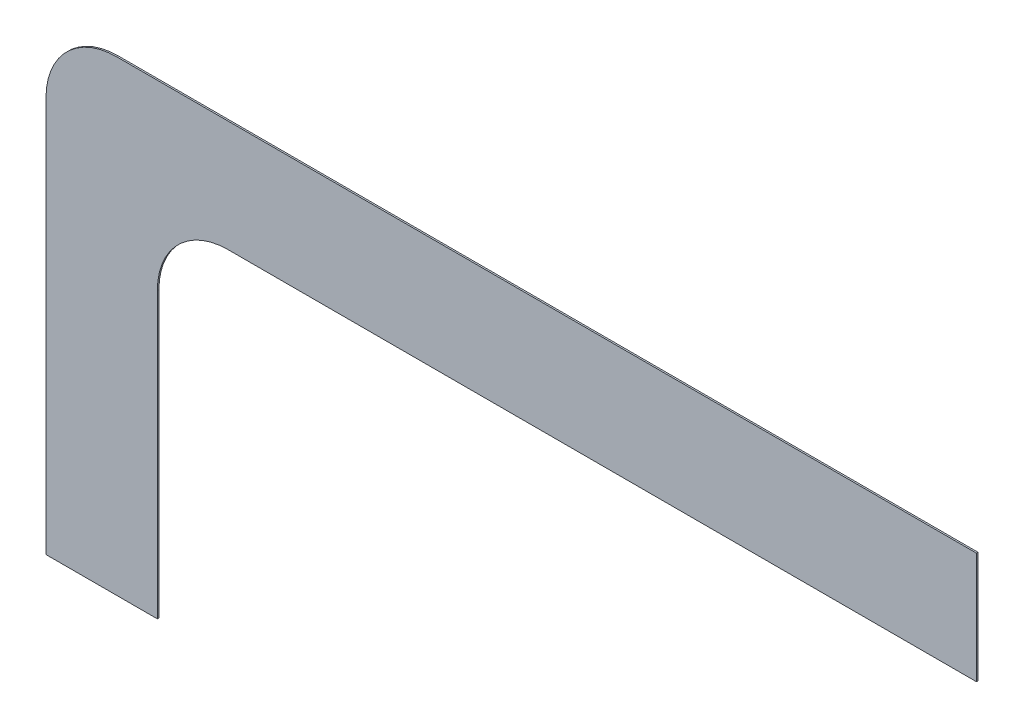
ISO-10303-21;
HEADER;
FILE_DESCRIPTION(('STEP AP214'),'2;1');
FILE_NAME('part.step','',(''),(''),'','','');
FILE_SCHEMA(('AUTOMOTIVE_DESIGN { 1 0 10303 214 1 1 1 1 }'));
ENDSEC;
DATA;
#1=APPLICATION_CONTEXT('core data for automotive mechanical design processes');
#2=APPLICATION_PROTOCOL_DEFINITION('international standard','automotive_design',2000,#1);
#3=PRODUCT_CONTEXT('',#1,'mechanical');
#4=PRODUCT('Part','Part','',(#3));
#5=PRODUCT_RELATED_PRODUCT_CATEGORY('part','',(#4));
#6=PRODUCT_DEFINITION_FORMATION('','',#4);
#7=PRODUCT_DEFINITION_CONTEXT('part definition',#1,'design');
#8=PRODUCT_DEFINITION('design','',#6,#7);
#9=PRODUCT_DEFINITION_SHAPE('','',#8);
#10=(LENGTH_UNIT() NAMED_UNIT(*) SI_UNIT(.MILLI.,.METRE.));
#11=(NAMED_UNIT(*) PLANE_ANGLE_UNIT() SI_UNIT($,.RADIAN.));
#12=(NAMED_UNIT(*) SI_UNIT($,.STERADIAN.) SOLID_ANGLE_UNIT());
#13=UNCERTAINTY_MEASURE_WITH_UNIT(LENGTH_MEASURE(1.E-05),#10,'distance_accuracy_value','');
#14=(GEOMETRIC_REPRESENTATION_CONTEXT(3) GLOBAL_UNCERTAINTY_ASSIGNED_CONTEXT((#13)) GLOBAL_UNIT_ASSIGNED_CONTEXT((#10,
#11,#12)) REPRESENTATION_CONTEXT('',''));
#15=CARTESIAN_POINT('',(0.,0.,0.));
#16=DIRECTION('',(0.,0.,1.));
#17=DIRECTION('',(1.,0.,0.));
#18=AXIS2_PLACEMENT_3D('',#15,#16,#17);
#19=CARTESIAN_POINT('',(33.5061595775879,-19.12,-0.949600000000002));
#20=DIRECTION('',(0.,-1.,0.));
#21=DIRECTION('',(-1.,0.,0.));
#22=AXIS2_PLACEMENT_3D('',#19,#20,#21);
#23=PLANE('',#22);
#24=DIRECTION('',(-1.,0.,0.));
#25=VECTOR('',#24,1.);
#26=CARTESIAN_POINT('',(33.5061595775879,-19.12,-0.949600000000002));
#27=LINE('',#26,#25);
#28=CARTESIAN_POINT('',(93.435,-19.12,-0.949599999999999));
#29=VERTEX_POINT('',#28);
#30=CARTESIAN_POINT('',(16.2277746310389,-19.12,-0.949600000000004));
#31=VERTEX_POINT('',#30);
#32=EDGE_CURVE('E12',#29,#31,#27,.T.);
#33=ORIENTED_EDGE('',*,*,#32,.T.);
#34=DIRECTION('',(0.,0.,-1.));
#35=VECTOR('',#34,1.);
#36=CARTESIAN_POINT('',(16.2277746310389,-19.12,-0.949600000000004));
#37=LINE('',#36,#35);
#38=CARTESIAN_POINT('',(16.2277746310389,-19.12,-0.809600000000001));
#39=VERTEX_POINT('',#38);
#40=EDGE_CURVE('E123',#39,#31,#37,.T.);
#41=ORIENTED_EDGE('',*,*,#40,.F.);
#42=DIRECTION('',(-1.,0.,0.));
#43=VECTOR('',#42,1.);
#44=CARTESIAN_POINT('',(33.5061595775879,-19.12,-0.809600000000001));
#45=LINE('',#44,#43);
#46=CARTESIAN_POINT('',(93.435,-19.12,-0.809599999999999));
#47=VERTEX_POINT('',#46);
#48=EDGE_CURVE('E49',#47,#39,#45,.T.);
#49=ORIENTED_EDGE('',*,*,#48,.F.);
#50=DIRECTION('',(0.,0.,-1.));
#51=VECTOR('',#50,1.);
#52=CARTESIAN_POINT('',(93.435,-19.12,-0.949599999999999));
#53=LINE('',#52,#51);
#54=EDGE_CURVE('E120',#47,#29,#53,.T.);
#55=ORIENTED_EDGE('',*,*,#54,.T.);
#56=EDGE_LOOP('',(#33,#41,#49,#55));
#57=FACE_BOUND('',#56,.T.);
#58=ADVANCED_FACE('F45',(#57),#23,.F.);
#59=CARTESIAN_POINT('',(33.5061595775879,-29.12,-0.949600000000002));
#60=DIRECTION('',(0.,-1.,0.));
#61=DIRECTION('',(-1.,0.,0.));
#62=AXIS2_PLACEMENT_3D('',#59,#60,#61);
#63=PLANE('',#62);
#64=DIRECTION('',(-1.,0.,0.));
#65=VECTOR('',#64,1.);
#66=CARTESIAN_POINT('',(33.5061595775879,-29.12,-0.949600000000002));
#67=LINE('',#66,#65);
#68=CARTESIAN_POINT('',(93.435,-29.12,-0.949599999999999));
#69=VERTEX_POINT('',#68);
#70=CARTESIAN_POINT('',(26.2277746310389,-29.12,-0.949600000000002));
#71=VERTEX_POINT('',#70);
#72=EDGE_CURVE('E55',#69,#71,#67,.T.);
#73=ORIENTED_EDGE('',*,*,#72,.F.);
#74=DIRECTION('',(0.,0.,-1.));
#75=VECTOR('',#74,1.);
#76=CARTESIAN_POINT('',(93.435,-29.12,-0.949599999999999));
#77=LINE('',#76,#75);
#78=CARTESIAN_POINT('',(93.435,-29.12,-0.809599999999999));
#79=VERTEX_POINT('',#78);
#80=EDGE_CURVE('E138',#79,#69,#77,.T.);
#81=ORIENTED_EDGE('',*,*,#80,.F.);
#82=DIRECTION('',(-1.,0.,0.));
#83=VECTOR('',#82,1.);
#84=CARTESIAN_POINT('',(33.5061595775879,-29.12,-0.809600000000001));
#85=LINE('',#84,#83);
#86=CARTESIAN_POINT('',(26.2277746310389,-29.12,-0.809600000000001));
#87=VERTEX_POINT('',#86);
#88=EDGE_CURVE('E108',#79,#87,#85,.T.);
#89=ORIENTED_EDGE('',*,*,#88,.T.);
#90=DIRECTION('',(0.,0.,-1.));
#91=VECTOR('',#90,1.);
#92=CARTESIAN_POINT('',(26.2277746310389,-29.12,-0.949600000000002));
#93=LINE('',#92,#91);
#94=EDGE_CURVE('E148',#87,#71,#93,.T.);
#95=ORIENTED_EDGE('',*,*,#94,.T.);
#96=EDGE_LOOP('',(#73,#81,#89,#95));
#97=FACE_BOUND('',#96,.T.);
#98=ADVANCED_FACE('F175',(#97),#63,.T.);
#99=CARTESIAN_POINT('',(75.9349999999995,-90.0207415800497,-0.949599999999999));
#100=DIRECTION('',(0.,0.,-1.));
#101=DIRECTION('',(-1.,0.,0.));
#102=AXIS2_PLACEMENT_3D('',#99,#100,#101);
#103=PLANE('',#102);
#104=ORIENTED_EDGE('',*,*,#32,.F.);
#105=DIRECTION('',(0.,1.,0.));
#106=VECTOR('',#105,1.);
#107=CARTESIAN_POINT('',(93.435,-90.0207415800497,-0.949599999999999));
#108=LINE('',#107,#106);
#109=EDGE_CURVE('E130',#69,#29,#108,.T.);
#110=ORIENTED_EDGE('',*,*,#109,.F.);
#111=ORIENTED_EDGE('',*,*,#72,.T.);
#112=CARTESIAN_POINT('',(26.2277746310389,-35.47,-0.949600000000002));
#113=DIRECTION('',(0.,0.,-1.));
#114=DIRECTION('',(-1.,0.,0.));
#115=AXIS2_PLACEMENT_3D('',#112,#113,#114);
#116=CIRCLE('',#115,6.35);
#117=CARTESIAN_POINT('',(19.8777746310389,-35.47,-0.949600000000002));
#118=VERTEX_POINT('',#117);
#119=EDGE_CURVE('E150',#71,#118,#116,.F.);
#120=ORIENTED_EDGE('',*,*,#119,.T.);
#121=DIRECTION('',(0.,1.,0.));
#122=VECTOR('',#121,1.);
#123=CARTESIAN_POINT('',(19.8777746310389,-29.12,-0.949600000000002));
#124=LINE('',#123,#122);
#125=CARTESIAN_POINT('',(19.8777746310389,-61.0106,-0.949600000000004));
#126=VERTEX_POINT('',#125);
#127=EDGE_CURVE('E169',#126,#118,#124,.T.);
#128=ORIENTED_EDGE('',*,*,#127,.F.);
#129=DIRECTION('',(1.,0.,0.));
#130=VECTOR('',#129,1.);
#131=CARTESIAN_POINT('',(9.87777463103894,-61.0106,-0.949600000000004));
#132=LINE('',#131,#130);
#133=CARTESIAN_POINT('',(9.87777463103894,-61.0106,-0.949600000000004));
#134=VERTEX_POINT('',#133);
#135=EDGE_CURVE('E134',#134,#126,#132,.T.);
#136=ORIENTED_EDGE('',*,*,#135,.F.);
#137=DIRECTION('',(0.,-1.,0.));
#138=VECTOR('',#137,1.);
#139=CARTESIAN_POINT('',(9.87777463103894,-19.12,-0.949600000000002));
#140=LINE('',#139,#138);
#141=CARTESIAN_POINT('',(9.87777463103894,-25.47,-0.949600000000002));
#142=VERTEX_POINT('',#141);
#143=EDGE_CURVE('E156',#142,#134,#140,.T.);
#144=ORIENTED_EDGE('',*,*,#143,.F.);
#145=CARTESIAN_POINT('',(16.2277746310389,-25.47,-0.949600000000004));
#146=DIRECTION('',(0.,0.,-1.));
#147=DIRECTION('',(-1.,0.,0.));
#148=AXIS2_PLACEMENT_3D('',#145,#146,#147);
#149=CIRCLE('',#148,6.35);
#150=EDGE_CURVE('E153',#142,#31,#149,.T.);
#151=ORIENTED_EDGE('',*,*,#150,.T.);
#152=EDGE_LOOP('',(#104,#110,#111,#120,#128,#136,#144,#151));
#153=FACE_BOUND('',#152,.T.);
#154=ADVANCED_FACE('F47',(#153),#103,.T.);
#155=CARTESIAN_POINT('',(33.5061595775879,-90.0207415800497,-0.809600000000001));
#156=DIRECTION('',(0.,0.,-1.));
#157=DIRECTION('',(-1.,0.,0.));
#158=AXIS2_PLACEMENT_3D('',#155,#156,#157);
#159=PLANE('',#158);
#160=ORIENTED_EDGE('',*,*,#88,.F.);
#161=DIRECTION('',(0.,1.,0.));
#162=VECTOR('',#161,1.);
#163=CARTESIAN_POINT('',(93.435,-90.0207415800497,-0.809599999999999));
#164=LINE('',#163,#162);
#165=EDGE_CURVE('E128',#79,#47,#164,.T.);
#166=ORIENTED_EDGE('',*,*,#165,.T.);
#167=ORIENTED_EDGE('',*,*,#48,.T.);
#168=CARTESIAN_POINT('',(16.2277746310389,-25.47,-0.809600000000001));
#169=DIRECTION('',(0.,0.,-1.));
#170=DIRECTION('',(-1.,0.,0.));
#171=AXIS2_PLACEMENT_3D('',#168,#169,#170);
#172=CIRCLE('',#171,6.35);
#173=CARTESIAN_POINT('',(9.87777463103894,-25.47,-0.809600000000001));
#174=VERTEX_POINT('',#173);
#175=EDGE_CURVE('E162',#174,#39,#172,.T.);
#176=ORIENTED_EDGE('',*,*,#175,.F.);
#177=DIRECTION('',(0.,1.,0.));
#178=VECTOR('',#177,1.);
#179=CARTESIAN_POINT('',(9.87777463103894,0.,-0.809600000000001));
#180=LINE('',#179,#178);
#181=CARTESIAN_POINT('',(9.87777463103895,-61.0106,-0.809600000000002));
#182=VERTEX_POINT('',#181);
#183=EDGE_CURVE('E145',#174,#182,#180,.F.);
#184=ORIENTED_EDGE('',*,*,#183,.T.);
#185=DIRECTION('',(-1.,0.,0.));
#186=VECTOR('',#185,1.);
#187=CARTESIAN_POINT('',(-0.302225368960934,-61.0106,-0.809600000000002));
#188=LINE('',#187,#186);
#189=CARTESIAN_POINT('',(19.8777746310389,-61.0106,-0.809600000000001));
#190=VERTEX_POINT('',#189);
#191=EDGE_CURVE('E143',#182,#190,#188,.F.);
#192=ORIENTED_EDGE('',*,*,#191,.T.);
#193=DIRECTION('',(0.,1.,0.));
#194=VECTOR('',#193,1.);
#195=CARTESIAN_POINT('',(19.8777746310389,0.,-0.809600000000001));
#196=LINE('',#195,#194);
#197=CARTESIAN_POINT('',(19.8777746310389,-35.47,-0.809600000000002));
#198=VERTEX_POINT('',#197);
#199=EDGE_CURVE('E140',#190,#198,#196,.T.);
#200=ORIENTED_EDGE('',*,*,#199,.T.);
#201=CARTESIAN_POINT('',(26.2277746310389,-35.47,-0.809600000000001));
#202=DIRECTION('',(0.,0.,-1.));
#203=DIRECTION('',(-1.,0.,0.));
#204=AXIS2_PLACEMENT_3D('',#201,#202,#203);
#205=CIRCLE('',#204,6.35);
#206=EDGE_CURVE('E166',#87,#198,#205,.F.);
#207=ORIENTED_EDGE('',*,*,#206,.F.);
#208=EDGE_LOOP('',(#160,#166,#167,#176,#184,#192,#200,#207));
#209=FACE_BOUND('',#208,.T.);
#210=ADVANCED_FACE('F132',(#209),#159,.F.);
#211=CARTESIAN_POINT('',(9.87777463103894,-61.0106,-0.949600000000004));
#212=DIRECTION('',(0.,1.,0.));
#213=DIRECTION('',(1.,0.,0.));
#214=AXIS2_PLACEMENT_3D('',#211,#212,#213);
#215=PLANE('',#214);
#216=DIRECTION('',(0.,0.,-1.));
#217=VECTOR('',#216,1.);
#218=CARTESIAN_POINT('',(19.8777746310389,-61.0106,-0.949600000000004));
#219=LINE('',#218,#217);
#220=EDGE_CURVE('E102',#190,#126,#219,.T.);
#221=ORIENTED_EDGE('',*,*,#220,.F.);
#222=ORIENTED_EDGE('',*,*,#191,.F.);
#223=DIRECTION('',(0.,0.,-1.));
#224=VECTOR('',#223,1.);
#225=CARTESIAN_POINT('',(9.87777463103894,-61.0106,-0.949600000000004));
#226=LINE('',#225,#224);
#227=EDGE_CURVE('E98',#182,#134,#226,.T.);
#228=ORIENTED_EDGE('',*,*,#227,.T.);
#229=ORIENTED_EDGE('',*,*,#135,.T.);
#230=EDGE_LOOP('',(#221,#222,#228,#229));
#231=FACE_BOUND('',#230,.T.);
#232=ADVANCED_FACE('F191',(#231),#215,.F.);
#233=CARTESIAN_POINT('',(19.8777746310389,-29.12,-0.949600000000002));
#234=DIRECTION('',(-1.,0.,0.));
#235=DIRECTION('',(0.,1.,0.));
#236=AXIS2_PLACEMENT_3D('',#233,#234,#235);
#237=PLANE('',#236);
#238=DIRECTION('',(0.,0.,-1.));
#239=VECTOR('',#238,1.);
#240=CARTESIAN_POINT('',(19.8777746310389,-35.47,-0.949600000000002));
#241=LINE('',#240,#239);
#242=EDGE_CURVE('E164',#198,#118,#241,.T.);
#243=ORIENTED_EDGE('',*,*,#242,.F.);
#244=ORIENTED_EDGE('',*,*,#199,.F.);
#245=ORIENTED_EDGE('',*,*,#220,.T.);
#246=ORIENTED_EDGE('',*,*,#127,.T.);
#247=EDGE_LOOP('',(#243,#244,#245,#246));
#248=FACE_BOUND('',#247,.T.);
#249=ADVANCED_FACE('F181',(#248),#237,.F.);
#250=CARTESIAN_POINT('',(26.2277746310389,-35.47,-0.949600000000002));
#251=DIRECTION('',(0.,0.,-1.));
#252=DIRECTION('',(-1.,0.,0.));
#253=AXIS2_PLACEMENT_3D('',#250,#251,#252);
#254=CYLINDRICAL_SURFACE('',#253,6.35);
#255=ORIENTED_EDGE('',*,*,#94,.F.);
#256=ORIENTED_EDGE('',*,*,#206,.T.);
#257=ORIENTED_EDGE('',*,*,#242,.T.);
#258=ORIENTED_EDGE('',*,*,#119,.F.);
#259=EDGE_LOOP('',(#255,#256,#257,#258));
#260=FACE_BOUND('',#259,.T.);
#261=ADVANCED_FACE('F178',(#260),#254,.F.);
#262=CARTESIAN_POINT('',(16.2277746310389,-25.47,-0.949600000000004));
#263=DIRECTION('',(0.,0.,-1.));
#264=DIRECTION('',(-1.,0.,0.));
#265=AXIS2_PLACEMENT_3D('',#262,#263,#264);
#266=CYLINDRICAL_SURFACE('',#265,6.35);
#267=DIRECTION('',(0.,0.,-1.));
#268=VECTOR('',#267,1.);
#269=CARTESIAN_POINT('',(9.87777463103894,-25.47,-0.949600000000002));
#270=LINE('',#269,#268);
#271=EDGE_CURVE('E159',#174,#142,#270,.T.);
#272=ORIENTED_EDGE('',*,*,#271,.F.);
#273=ORIENTED_EDGE('',*,*,#175,.T.);
#274=ORIENTED_EDGE('',*,*,#40,.T.);
#275=ORIENTED_EDGE('',*,*,#150,.F.);
#276=EDGE_LOOP('',(#272,#273,#274,#275));
#277=FACE_BOUND('',#276,.T.);
#278=ADVANCED_FACE('F187',(#277),#266,.T.);
#279=CARTESIAN_POINT('',(9.87777463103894,-19.12,-0.949600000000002));
#280=DIRECTION('',(1.,0.,0.));
#281=DIRECTION('',(0.,-1.,0.));
#282=AXIS2_PLACEMENT_3D('',#279,#280,#281);
#283=PLANE('',#282);
#284=ORIENTED_EDGE('',*,*,#227,.F.);
#285=ORIENTED_EDGE('',*,*,#183,.F.);
#286=ORIENTED_EDGE('',*,*,#271,.T.);
#287=ORIENTED_EDGE('',*,*,#143,.T.);
#288=EDGE_LOOP('',(#284,#285,#286,#287));
#289=FACE_BOUND('',#288,.T.);
#290=ADVANCED_FACE('F190',(#289),#283,.F.);
#291=CARTESIAN_POINT('',(93.435,-90.0207415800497,-0.949599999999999));
#292=DIRECTION('',(-1.,0.,0.));
#293=DIRECTION('',(0.,1.,0.));
#294=AXIS2_PLACEMENT_3D('',#291,#292,#293);
#295=PLANE('',#294);
#296=ORIENTED_EDGE('',*,*,#54,.F.);
#297=ORIENTED_EDGE('',*,*,#165,.F.);
#298=ORIENTED_EDGE('',*,*,#80,.T.);
#299=ORIENTED_EDGE('',*,*,#109,.T.);
#300=EDGE_LOOP('',(#296,#297,#298,#299));
#301=FACE_BOUND('',#300,.T.);
#302=ADVANCED_FACE('F127',(#301),#295,.F.);
#303=CLOSED_SHELL('',(#58,#98,#154,#210,#232,#249,#261,#278,#290,#302));
#304=MANIFOLD_SOLID_BREP('B2',#303);
#305=ADVANCED_BREP_SHAPE_REPRESENTATION('',(#18,#304),#14);
#306=SHAPE_DEFINITION_REPRESENTATION(#9,#305);
ENDSEC;
END-ISO-10303-21;
